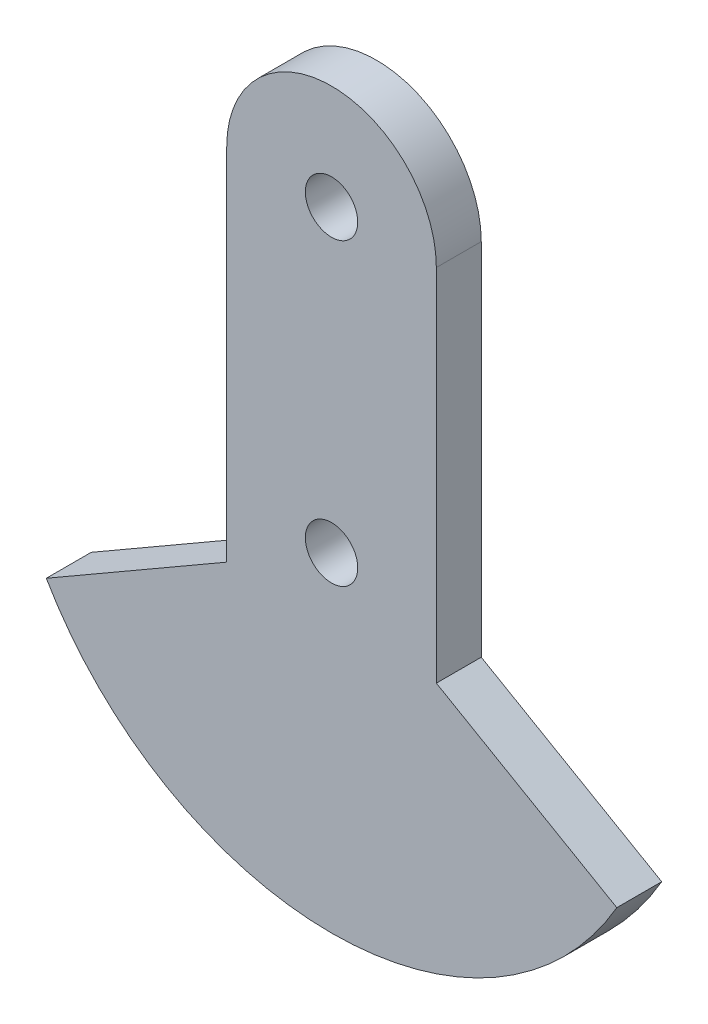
ISO-10303-21;
HEADER;
FILE_DESCRIPTION(('STEP AP214'),'2;1');
FILE_NAME('part.step','',(''),(''),'','','');
FILE_SCHEMA(('AUTOMOTIVE_DESIGN { 1 0 10303 214 1 1 1 1 }'));
ENDSEC;
DATA;
#1=APPLICATION_CONTEXT('core data for automotive mechanical design processes');
#2=APPLICATION_PROTOCOL_DEFINITION('international standard','automotive_design',2000,#1);
#3=PRODUCT_CONTEXT('',#1,'mechanical');
#4=PRODUCT('Part','Part','',(#3));
#5=PRODUCT_RELATED_PRODUCT_CATEGORY('part','',(#4));
#6=PRODUCT_DEFINITION_FORMATION('','',#4);
#7=PRODUCT_DEFINITION_CONTEXT('part definition',#1,'design');
#8=PRODUCT_DEFINITION('design','',#6,#7);
#9=PRODUCT_DEFINITION_SHAPE('','',#8);
#10=(LENGTH_UNIT() NAMED_UNIT(*) SI_UNIT(.MILLI.,.METRE.));
#11=(NAMED_UNIT(*) PLANE_ANGLE_UNIT() SI_UNIT($,.RADIAN.));
#12=(NAMED_UNIT(*) SI_UNIT($,.STERADIAN.) SOLID_ANGLE_UNIT());
#13=UNCERTAINTY_MEASURE_WITH_UNIT(LENGTH_MEASURE(1.E-05),#10,'distance_accuracy_value','');
#14=(GEOMETRIC_REPRESENTATION_CONTEXT(3) GLOBAL_UNCERTAINTY_ASSIGNED_CONTEXT((#13)) GLOBAL_UNIT_ASSIGNED_CONTEXT((#10,
#11,#12)) REPRESENTATION_CONTEXT('',''));
#15=CARTESIAN_POINT('',(0.,0.,0.));
#16=DIRECTION('',(0.,0.,1.));
#17=DIRECTION('',(1.,0.,0.));
#18=AXIS2_PLACEMENT_3D('',#15,#16,#17);
#19=CARTESIAN_POINT('',(0.,-20.,3.));
#20=DIRECTION('',(0.,0.,1.));
#21=DIRECTION('',(1.,0.,0.));
#22=AXIS2_PLACEMENT_3D('',#19,#20,#21);
#23=PLANE('',#22);
#24=CARTESIAN_POINT('',(0.,0.,3.));
#25=DIRECTION('',(0.,0.,1.));
#26=DIRECTION('',(1.,0.,0.));
#27=AXIS2_PLACEMENT_3D('',#24,#25,#26);
#28=CIRCLE('',#27,1.75);
#29=CARTESIAN_POINT('',(1.75,0.,3.));
#30=VERTEX_POINT('',#29);
#31=EDGE_CURVE('E119',#30,#30,#28,.T.);
#32=ORIENTED_EDGE('',*,*,#31,.F.);
#33=EDGE_LOOP('',(#32));
#34=FACE_BOUND('',#33,.T.);
#35=CARTESIAN_POINT('',(0.,-20.,3.));
#36=DIRECTION('',(0.,0.,1.));
#37=DIRECTION('',(1.,0.,0.));
#38=AXIS2_PLACEMENT_3D('',#35,#36,#37);
#39=CIRCLE('',#38,22.);
#40=CARTESIAN_POINT('',(-19.0525588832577,-31.,3.));
#41=VERTEX_POINT('',#40);
#42=CARTESIAN_POINT('',(19.0525588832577,-30.9999999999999,3.));
#43=VERTEX_POINT('',#42);
#44=EDGE_CURVE('E126',#41,#43,#39,.T.);
#45=ORIENTED_EDGE('',*,*,#44,.T.);
#46=DIRECTION('',(-0.86602540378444,0.499999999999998,0.));
#47=VECTOR('',#46,1.);
#48=CARTESIAN_POINT('',(7.,-24.0414518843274,3.));
#49=LINE('',#48,#47);
#50=CARTESIAN_POINT('',(7.,-24.0414518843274,3.));
#51=VERTEX_POINT('',#50);
#52=EDGE_CURVE('E84',#43,#51,#49,.T.);
#53=ORIENTED_EDGE('',*,*,#52,.T.);
#54=DIRECTION('',(0.,1.,0.));
#55=VECTOR('',#54,1.);
#56=CARTESIAN_POINT('',(7.,0.,3.));
#57=LINE('',#56,#55);
#58=CARTESIAN_POINT('',(7.,0.,3.));
#59=VERTEX_POINT('',#58);
#60=EDGE_CURVE('E97',#51,#59,#57,.T.);
#61=ORIENTED_EDGE('',*,*,#60,.T.);
#62=CARTESIAN_POINT('',(0.,0.,3.));
#63=DIRECTION('',(0.,0.,1.));
#64=DIRECTION('',(1.,0.,0.));
#65=AXIS2_PLACEMENT_3D('',#62,#63,#64);
#66=CIRCLE('',#65,7.);
#67=CARTESIAN_POINT('',(-7.,0.,3.));
#68=VERTEX_POINT('',#67);
#69=EDGE_CURVE('E91',#59,#68,#66,.T.);
#70=ORIENTED_EDGE('',*,*,#69,.T.);
#71=DIRECTION('',(0.,-1.,0.));
#72=VECTOR('',#71,1.);
#73=CARTESIAN_POINT('',(-7.,0.,3.));
#74=LINE('',#73,#72);
#75=CARTESIAN_POINT('',(-7.,-24.0414518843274,3.));
#76=VERTEX_POINT('',#75);
#77=EDGE_CURVE('E95',#68,#76,#74,.T.);
#78=ORIENTED_EDGE('',*,*,#77,.T.);
#79=DIRECTION('',(-0.86602540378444,-0.499999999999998,0.));
#80=VECTOR('',#79,1.);
#81=CARTESIAN_POINT('',(-7.,-24.0414518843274,3.));
#82=LINE('',#81,#80);
#83=EDGE_CURVE('E47',#76,#41,#82,.T.);
#84=ORIENTED_EDGE('',*,*,#83,.T.);
#85=EDGE_LOOP('',(#45,#53,#61,#70,#78,#84));
#86=FACE_BOUND('',#85,.T.);
#87=CARTESIAN_POINT('',(0.,-20.,3.));
#88=DIRECTION('',(0.,0.,1.));
#89=DIRECTION('',(1.,0.,0.));
#90=AXIS2_PLACEMENT_3D('',#87,#88,#89);
#91=CIRCLE('',#90,1.75);
#92=CARTESIAN_POINT('',(1.75,-20.,3.));
#93=VERTEX_POINT('',#92);
#94=EDGE_CURVE('E169',#93,#93,#91,.T.);
#95=ORIENTED_EDGE('',*,*,#94,.F.);
#96=EDGE_LOOP('',(#95));
#97=FACE_BOUND('',#96,.T.);
#98=ADVANCED_FACE('F30',(#34,#86,#97),#23,.T.);
#99=CARTESIAN_POINT('',(0.,-20.,0.));
#100=DIRECTION('',(0.,0.,1.));
#101=DIRECTION('',(1.,0.,0.));
#102=AXIS2_PLACEMENT_3D('',#99,#100,#101);
#103=PLANE('',#102);
#104=CARTESIAN_POINT('',(0.,0.,0.));
#105=DIRECTION('',(0.,0.,1.));
#106=DIRECTION('',(1.,0.,0.));
#107=AXIS2_PLACEMENT_3D('',#104,#105,#106);
#108=CIRCLE('',#107,1.75);
#109=CARTESIAN_POINT('',(1.75,0.,0.));
#110=VERTEX_POINT('',#109);
#111=EDGE_CURVE('E174',#110,#110,#108,.T.);
#112=ORIENTED_EDGE('',*,*,#111,.T.);
#113=EDGE_LOOP('',(#112));
#114=FACE_BOUND('',#113,.T.);
#115=CARTESIAN_POINT('',(0.,-20.,0.));
#116=DIRECTION('',(0.,0.,1.));
#117=DIRECTION('',(1.,0.,0.));
#118=AXIS2_PLACEMENT_3D('',#115,#116,#117);
#119=CIRCLE('',#118,22.);
#120=CARTESIAN_POINT('',(-19.0525588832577,-31.,0.));
#121=VERTEX_POINT('',#120);
#122=CARTESIAN_POINT('',(19.0525588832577,-30.9999999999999,0.));
#123=VERTEX_POINT('',#122);
#124=EDGE_CURVE('E115',#121,#123,#119,.T.);
#125=ORIENTED_EDGE('',*,*,#124,.F.);
#126=DIRECTION('',(-0.86602540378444,-0.499999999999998,0.));
#127=VECTOR('',#126,1.);
#128=CARTESIAN_POINT('',(-7.,-24.0414518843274,0.));
#129=LINE('',#128,#127);
#130=CARTESIAN_POINT('',(-7.,-24.0414518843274,0.));
#131=VERTEX_POINT('',#130);
#132=EDGE_CURVE('E76',#131,#121,#129,.T.);
#133=ORIENTED_EDGE('',*,*,#132,.F.);
#134=DIRECTION('',(0.,-1.,0.));
#135=VECTOR('',#134,1.);
#136=CARTESIAN_POINT('',(-7.,0.,0.));
#137=LINE('',#136,#135);
#138=CARTESIAN_POINT('',(-7.,0.,0.));
#139=VERTEX_POINT('',#138);
#140=EDGE_CURVE('E70',#139,#131,#137,.T.);
#141=ORIENTED_EDGE('',*,*,#140,.F.);
#142=CARTESIAN_POINT('',(0.,0.,0.));
#143=DIRECTION('',(0.,0.,1.));
#144=DIRECTION('',(1.,0.,0.));
#145=AXIS2_PLACEMENT_3D('',#142,#143,#144);
#146=CIRCLE('',#145,7.);
#147=CARTESIAN_POINT('',(7.,0.,0.));
#148=VERTEX_POINT('',#147);
#149=EDGE_CURVE('E105',#148,#139,#146,.T.);
#150=ORIENTED_EDGE('',*,*,#149,.F.);
#151=DIRECTION('',(0.,1.,0.));
#152=VECTOR('',#151,1.);
#153=CARTESIAN_POINT('',(7.,0.,0.));
#154=LINE('',#153,#152);
#155=CARTESIAN_POINT('',(7.,-24.0414518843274,0.));
#156=VERTEX_POINT('',#155);
#157=EDGE_CURVE('E121',#156,#148,#154,.T.);
#158=ORIENTED_EDGE('',*,*,#157,.F.);
#159=DIRECTION('',(-0.86602540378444,0.499999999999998,0.));
#160=VECTOR('',#159,1.);
#161=CARTESIAN_POINT('',(7.,-24.0414518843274,0.));
#162=LINE('',#161,#160);
#163=EDGE_CURVE('E118',#123,#156,#162,.T.);
#164=ORIENTED_EDGE('',*,*,#163,.F.);
#165=EDGE_LOOP('',(#125,#133,#141,#150,#158,#164));
#166=FACE_BOUND('',#165,.T.);
#167=CARTESIAN_POINT('',(0.,-20.,0.));
#168=DIRECTION('',(0.,0.,1.));
#169=DIRECTION('',(1.,0.,0.));
#170=AXIS2_PLACEMENT_3D('',#167,#168,#169);
#171=CIRCLE('',#170,1.75);
#172=CARTESIAN_POINT('',(1.75,-20.,0.));
#173=VERTEX_POINT('',#172);
#174=EDGE_CURVE('E172',#173,#173,#171,.T.);
#175=ORIENTED_EDGE('',*,*,#174,.T.);
#176=EDGE_LOOP('',(#175));
#177=FACE_BOUND('',#176,.T.);
#178=ADVANCED_FACE('F135',(#114,#166,#177),#103,.F.);
#179=CARTESIAN_POINT('',(0.,-20.,3.));
#180=DIRECTION('',(0.,0.,-1.));
#181=DIRECTION('',(-1.,0.,0.));
#182=AXIS2_PLACEMENT_3D('',#179,#180,#181);
#183=CYLINDRICAL_SURFACE('',#182,22.);
#184=ORIENTED_EDGE('',*,*,#124,.T.);
#185=DIRECTION('',(0.,0.,-1.));
#186=VECTOR('',#185,1.);
#187=CARTESIAN_POINT('',(19.0525588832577,-30.9999999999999,3.));
#188=LINE('',#187,#186);
#189=EDGE_CURVE('E11',#43,#123,#188,.T.);
#190=ORIENTED_EDGE('',*,*,#189,.F.);
#191=ORIENTED_EDGE('',*,*,#44,.F.);
#192=DIRECTION('',(0.,0.,-1.));
#193=VECTOR('',#192,1.);
#194=CARTESIAN_POINT('',(-19.0525588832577,-31.,3.));
#195=LINE('',#194,#193);
#196=EDGE_CURVE('E111',#41,#121,#195,.T.);
#197=ORIENTED_EDGE('',*,*,#196,.T.);
#198=EDGE_LOOP('',(#184,#190,#191,#197));
#199=FACE_BOUND('',#198,.T.);
#200=ADVANCED_FACE('F32',(#199),#183,.T.);
#201=CARTESIAN_POINT('',(7.,-24.0414518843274,3.));
#202=DIRECTION('',(-0.499999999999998,-0.86602540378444,0.));
#203=DIRECTION('',(0.86602540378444,-0.499999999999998,0.));
#204=AXIS2_PLACEMENT_3D('',#201,#202,#203);
#205=PLANE('',#204);
#206=ORIENTED_EDGE('',*,*,#163,.T.);
#207=DIRECTION('',(0.,0.,-1.));
#208=VECTOR('',#207,1.);
#209=CARTESIAN_POINT('',(7.,-24.0414518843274,3.));
#210=LINE('',#209,#208);
#211=EDGE_CURVE('E39',#51,#156,#210,.T.);
#212=ORIENTED_EDGE('',*,*,#211,.F.);
#213=ORIENTED_EDGE('',*,*,#52,.F.);
#214=ORIENTED_EDGE('',*,*,#189,.T.);
#215=EDGE_LOOP('',(#206,#212,#213,#214));
#216=FACE_BOUND('',#215,.T.);
#217=ADVANCED_FACE('F215',(#216),#205,.F.);
#218=CARTESIAN_POINT('',(7.,0.,3.));
#219=DIRECTION('',(-1.,0.,0.));
#220=DIRECTION('',(0.,-1.,0.));
#221=AXIS2_PLACEMENT_3D('',#218,#219,#220);
#222=PLANE('',#221);
#223=ORIENTED_EDGE('',*,*,#157,.T.);
#224=DIRECTION('',(0.,0.,-1.));
#225=VECTOR('',#224,1.);
#226=CARTESIAN_POINT('',(7.,0.,3.));
#227=LINE('',#226,#225);
#228=EDGE_CURVE('E106',#59,#148,#227,.T.);
#229=ORIENTED_EDGE('',*,*,#228,.F.);
#230=ORIENTED_EDGE('',*,*,#60,.F.);
#231=ORIENTED_EDGE('',*,*,#211,.T.);
#232=EDGE_LOOP('',(#223,#229,#230,#231));
#233=FACE_BOUND('',#232,.T.);
#234=ADVANCED_FACE('F132',(#233),#222,.F.);
#235=CARTESIAN_POINT('',(0.,0.,3.));
#236=DIRECTION('',(0.,0.,-1.));
#237=DIRECTION('',(-1.,0.,0.));
#238=AXIS2_PLACEMENT_3D('',#235,#236,#237);
#239=CYLINDRICAL_SURFACE('',#238,7.);
#240=ORIENTED_EDGE('',*,*,#149,.T.);
#241=DIRECTION('',(0.,0.,-1.));
#242=VECTOR('',#241,1.);
#243=CARTESIAN_POINT('',(-7.,0.,3.));
#244=LINE('',#243,#242);
#245=EDGE_CURVE('E102',#68,#139,#244,.T.);
#246=ORIENTED_EDGE('',*,*,#245,.F.);
#247=ORIENTED_EDGE('',*,*,#69,.F.);
#248=ORIENTED_EDGE('',*,*,#228,.T.);
#249=EDGE_LOOP('',(#240,#246,#247,#248));
#250=FACE_BOUND('',#249,.T.);
#251=ADVANCED_FACE('F103',(#250),#239,.T.);
#252=CARTESIAN_POINT('',(-7.,0.,3.));
#253=DIRECTION('',(1.,0.,0.));
#254=DIRECTION('',(0.,1.,0.));
#255=AXIS2_PLACEMENT_3D('',#252,#253,#254);
#256=PLANE('',#255);
#257=ORIENTED_EDGE('',*,*,#140,.T.);
#258=DIRECTION('',(0.,0.,-1.));
#259=VECTOR('',#258,1.);
#260=CARTESIAN_POINT('',(-7.,-24.0414518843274,3.));
#261=LINE('',#260,#259);
#262=EDGE_CURVE('E107',#76,#131,#261,.T.);
#263=ORIENTED_EDGE('',*,*,#262,.F.);
#264=ORIENTED_EDGE('',*,*,#77,.F.);
#265=ORIENTED_EDGE('',*,*,#245,.T.);
#266=EDGE_LOOP('',(#257,#263,#264,#265));
#267=FACE_BOUND('',#266,.T.);
#268=ADVANCED_FACE('F109',(#267),#256,.F.);
#269=CARTESIAN_POINT('',(-7.,-24.0414518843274,3.));
#270=DIRECTION('',(0.499999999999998,-0.86602540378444,0.));
#271=DIRECTION('',(0.86602540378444,0.499999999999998,0.));
#272=AXIS2_PLACEMENT_3D('',#269,#270,#271);
#273=PLANE('',#272);
#274=ORIENTED_EDGE('',*,*,#132,.T.);
#275=ORIENTED_EDGE('',*,*,#196,.F.);
#276=ORIENTED_EDGE('',*,*,#83,.F.);
#277=ORIENTED_EDGE('',*,*,#262,.T.);
#278=EDGE_LOOP('',(#274,#275,#276,#277));
#279=FACE_BOUND('',#278,.T.);
#280=ADVANCED_FACE('F140',(#279),#273,.F.);
#281=CARTESIAN_POINT('',(0.,0.,3.));
#282=DIRECTION('',(0.,0.,-1.));
#283=DIRECTION('',(-1.,0.,0.));
#284=AXIS2_PLACEMENT_3D('',#281,#282,#283);
#285=CYLINDRICAL_SURFACE('',#284,1.75);
#286=ORIENTED_EDGE('',*,*,#31,.T.);
#287=EDGE_LOOP('',(#286));
#288=FACE_BOUND('',#287,.T.);
#289=ORIENTED_EDGE('',*,*,#111,.F.);
#290=EDGE_LOOP('',(#289));
#291=FACE_BOUND('',#290,.T.);
#292=ADVANCED_FACE('F142',(#288,#291),#285,.F.);
#293=CARTESIAN_POINT('',(0.,-20.,3.));
#294=DIRECTION('',(0.,0.,-1.));
#295=DIRECTION('',(-1.,0.,0.));
#296=AXIS2_PLACEMENT_3D('',#293,#294,#295);
#297=CYLINDRICAL_SURFACE('',#296,1.75);
#298=ORIENTED_EDGE('',*,*,#94,.T.);
#299=EDGE_LOOP('',(#298));
#300=FACE_BOUND('',#299,.T.);
#301=ORIENTED_EDGE('',*,*,#174,.F.);
#302=EDGE_LOOP('',(#301));
#303=FACE_BOUND('',#302,.T.);
#304=ADVANCED_FACE('F148',(#300,#303),#297,.F.);
#305=CLOSED_SHELL('',(#98,#178,#200,#217,#234,#251,#268,#280,#292,#304));
#306=MANIFOLD_SOLID_BREP('B2',#305);
#307=ADVANCED_BREP_SHAPE_REPRESENTATION('',(#18,#306),#14);
#308=SHAPE_DEFINITION_REPRESENTATION(#9,#307);
ENDSEC;
END-ISO-10303-21;
